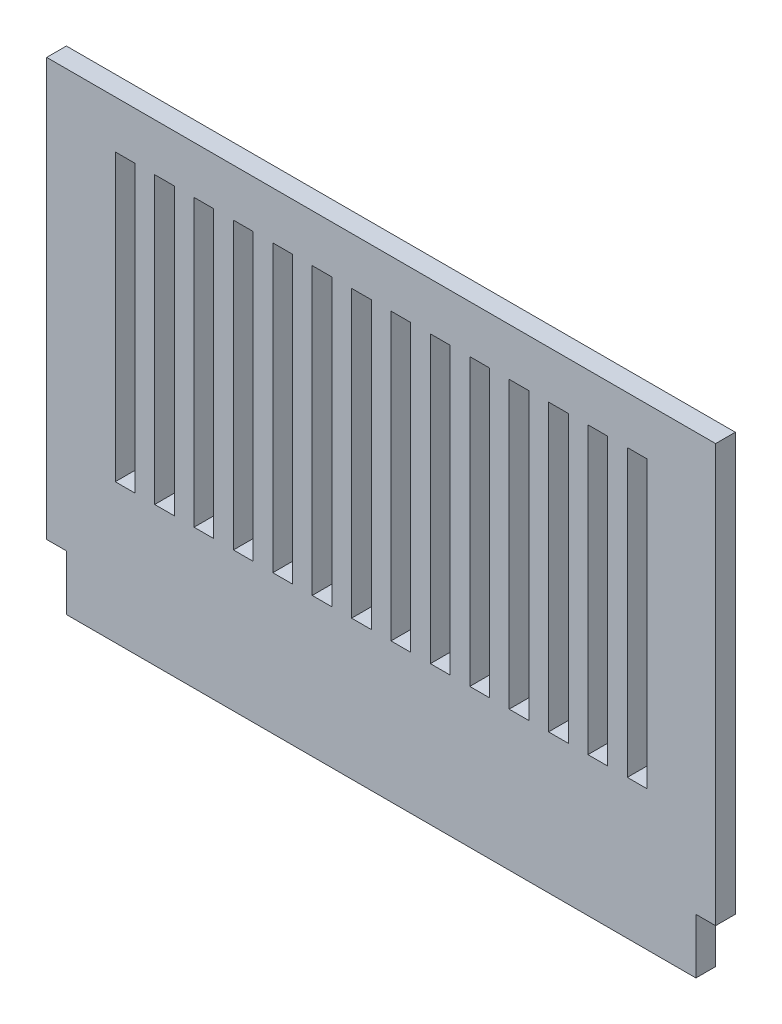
from build123d import *

# Parameters (mm, degrees)
SKETCH1_W           = 3.175
SKETCH1_H           = 46.050095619
BOSS_EXTRUDE1_DEPTH = 3.175


with BuildPart() as part:
    # Sketch1 → Boss-Extrude1 (new body)
    with BuildSketch(Plane.XY):
        Polygon((-3.175, 68.58), (104.662917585, 68.58), (104.662917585, 1.27), (101.487917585, 1.27), (101.487917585, -7.62), (0, -7.62), (0, 1.27), (-3.175, 1.27), align=None)
        with Locations((53.918958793, 37.886580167)):
            Rectangle(SKETCH1_W, SKETCH1_H, mode=Mode.SUBTRACT)
        with Locations((60.268958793, 37.886580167)):
            Rectangle(SKETCH1_W, SKETCH1_H, mode=Mode.SUBTRACT)
        with Locations((66.618958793, 37.886580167)):
            Rectangle(SKETCH1_W, SKETCH1_H, mode=Mode.SUBTRACT)
        with Locations((72.968958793, 37.886580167)):
            Rectangle(SKETCH1_W, SKETCH1_H, mode=Mode.SUBTRACT)
        with Locations((79.318958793, 37.886580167)):
            Rectangle(SKETCH1_W, SKETCH1_H, mode=Mode.SUBTRACT)
        with Locations((85.668958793, 37.886580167)):
            Rectangle(SKETCH1_W, SKETCH1_H, mode=Mode.SUBTRACT)
        with Locations((92.018958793, 37.886580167)):
            Rectangle(SKETCH1_W, SKETCH1_H, mode=Mode.SUBTRACT)
        with Locations((9.468958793, 37.886580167)):
            Rectangle(SKETCH1_W, SKETCH1_H, mode=Mode.SUBTRACT)
        with Locations((15.818958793, 37.886580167)):
            Rectangle(SKETCH1_W, SKETCH1_H, mode=Mode.SUBTRACT)
        with Locations((22.168958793, 37.886580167)):
            Rectangle(SKETCH1_W, SKETCH1_H, mode=Mode.SUBTRACT)
        with Locations((28.518958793, 37.886580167)):
            Rectangle(SKETCH1_W, SKETCH1_H, mode=Mode.SUBTRACT)
        with Locations((34.868958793, 37.886580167)):
            Rectangle(SKETCH1_W, SKETCH1_H, mode=Mode.SUBTRACT)
        with Locations((41.218958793, 37.886580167)):
            Rectangle(SKETCH1_W, SKETCH1_H, mode=Mode.SUBTRACT)
        with Locations((47.568958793, 37.886580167)):
            Rectangle(SKETCH1_W, SKETCH1_H, mode=Mode.SUBTRACT)
    extrude(amount=BOSS_EXTRUDE1_DEPTH)


solid = part.part
